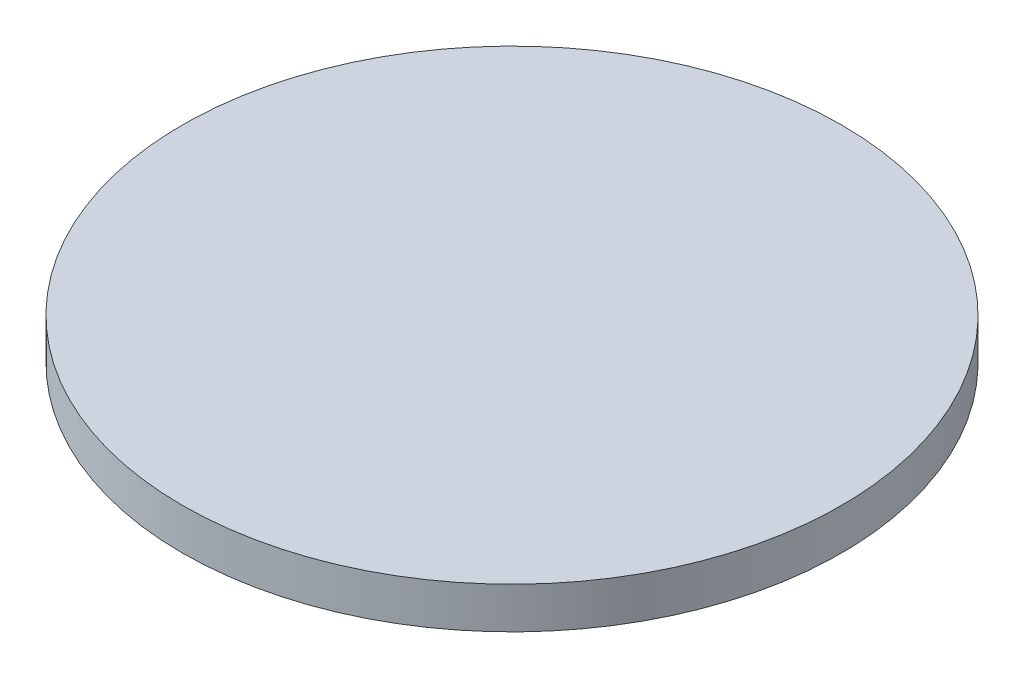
ISO-10303-21;
HEADER;
FILE_DESCRIPTION(('STEP AP214'),'2;1');
FILE_NAME('part.step','',(''),(''),'','','');
FILE_SCHEMA(('AUTOMOTIVE_DESIGN { 1 0 10303 214 1 1 1 1 }'));
ENDSEC;
DATA;
#1=APPLICATION_CONTEXT('core data for automotive mechanical design processes');
#2=APPLICATION_PROTOCOL_DEFINITION('international standard','automotive_design',2000,#1);
#3=PRODUCT_CONTEXT('',#1,'mechanical');
#4=PRODUCT('Part','Part','',(#3));
#5=PRODUCT_RELATED_PRODUCT_CATEGORY('part','',(#4));
#6=PRODUCT_DEFINITION_FORMATION('','',#4);
#7=PRODUCT_DEFINITION_CONTEXT('part definition',#1,'design');
#8=PRODUCT_DEFINITION('design','',#6,#7);
#9=PRODUCT_DEFINITION_SHAPE('','',#8);
#10=(LENGTH_UNIT() NAMED_UNIT(*) SI_UNIT(.MILLI.,.METRE.));
#11=(NAMED_UNIT(*) PLANE_ANGLE_UNIT() SI_UNIT($,.RADIAN.));
#12=(NAMED_UNIT(*) SI_UNIT($,.STERADIAN.) SOLID_ANGLE_UNIT());
#13=UNCERTAINTY_MEASURE_WITH_UNIT(LENGTH_MEASURE(1.E-05),#10,'distance_accuracy_value','');
#14=(GEOMETRIC_REPRESENTATION_CONTEXT(3) GLOBAL_UNCERTAINTY_ASSIGNED_CONTEXT((#13)) GLOBAL_UNIT_ASSIGNED_CONTEXT((#10,
#11,#12)) REPRESENTATION_CONTEXT('',''));
#15=CARTESIAN_POINT('',(0.,0.,0.));
#16=DIRECTION('',(0.,0.,1.));
#17=DIRECTION('',(1.,0.,0.));
#18=AXIS2_PLACEMENT_3D('',#15,#16,#17);
#19=CARTESIAN_POINT('',(0.,1.5875,0.));
#20=DIRECTION('',(0.,-1.,0.));
#21=DIRECTION('',(0.,0.,-1.));
#22=AXIS2_PLACEMENT_3D('',#19,#20,#21);
#23=CYLINDRICAL_SURFACE('',#22,12.6746);
#24=CARTESIAN_POINT('',(0.,1.5875,0.));
#25=DIRECTION('',(0.,1.,0.));
#26=DIRECTION('',(0.,0.,1.));
#27=AXIS2_PLACEMENT_3D('',#24,#25,#26);
#28=CIRCLE('',#27,12.6746);
#29=CARTESIAN_POINT('',(0.,1.5875,12.6746));
#30=VERTEX_POINT('',#29);
#31=EDGE_CURVE('E10',#30,#30,#28,.T.);
#32=ORIENTED_EDGE('',*,*,#31,.F.);
#33=EDGE_LOOP('',(#32));
#34=FACE_BOUND('',#33,.T.);
#35=CARTESIAN_POINT('',(0.,0.,0.));
#36=DIRECTION('',(0.,1.,0.));
#37=DIRECTION('',(0.,0.,1.));
#38=AXIS2_PLACEMENT_3D('',#35,#36,#37);
#39=CIRCLE('',#38,12.6746);
#40=CARTESIAN_POINT('',(0.,0.,12.6746));
#41=VERTEX_POINT('',#40);
#42=EDGE_CURVE('E32',#41,#41,#39,.T.);
#43=ORIENTED_EDGE('',*,*,#42,.T.);
#44=EDGE_LOOP('',(#43));
#45=FACE_BOUND('',#44,.T.);
#46=ADVANCED_FACE('F29',(#34,#45),#23,.T.);
#47=CARTESIAN_POINT('',(0.,1.5875,0.));
#48=DIRECTION('',(0.,1.,0.));
#49=DIRECTION('',(0.,0.,1.));
#50=AXIS2_PLACEMENT_3D('',#47,#48,#49);
#51=PLANE('',#50);
#52=ORIENTED_EDGE('',*,*,#31,.T.);
#53=EDGE_LOOP('',(#52));
#54=FACE_BOUND('',#53,.T.);
#55=ADVANCED_FACE('F44',(#54),#51,.T.);
#56=CARTESIAN_POINT('',(0.,0.,0.));
#57=DIRECTION('',(0.,1.,0.));
#58=DIRECTION('',(0.,0.,1.));
#59=AXIS2_PLACEMENT_3D('',#56,#57,#58);
#60=PLANE('',#59);
#61=ORIENTED_EDGE('',*,*,#42,.F.);
#62=EDGE_LOOP('',(#61));
#63=FACE_BOUND('',#62,.T.);
#64=ADVANCED_FACE('F42',(#63),#60,.F.);
#65=CLOSED_SHELL('',(#46,#55,#64));
#66=MANIFOLD_SOLID_BREP('B2',#65);
#67=ADVANCED_BREP_SHAPE_REPRESENTATION('',(#18,#66),#14);
#68=SHAPE_DEFINITION_REPRESENTATION(#9,#67);
ENDSEC;
END-ISO-10303-21;
